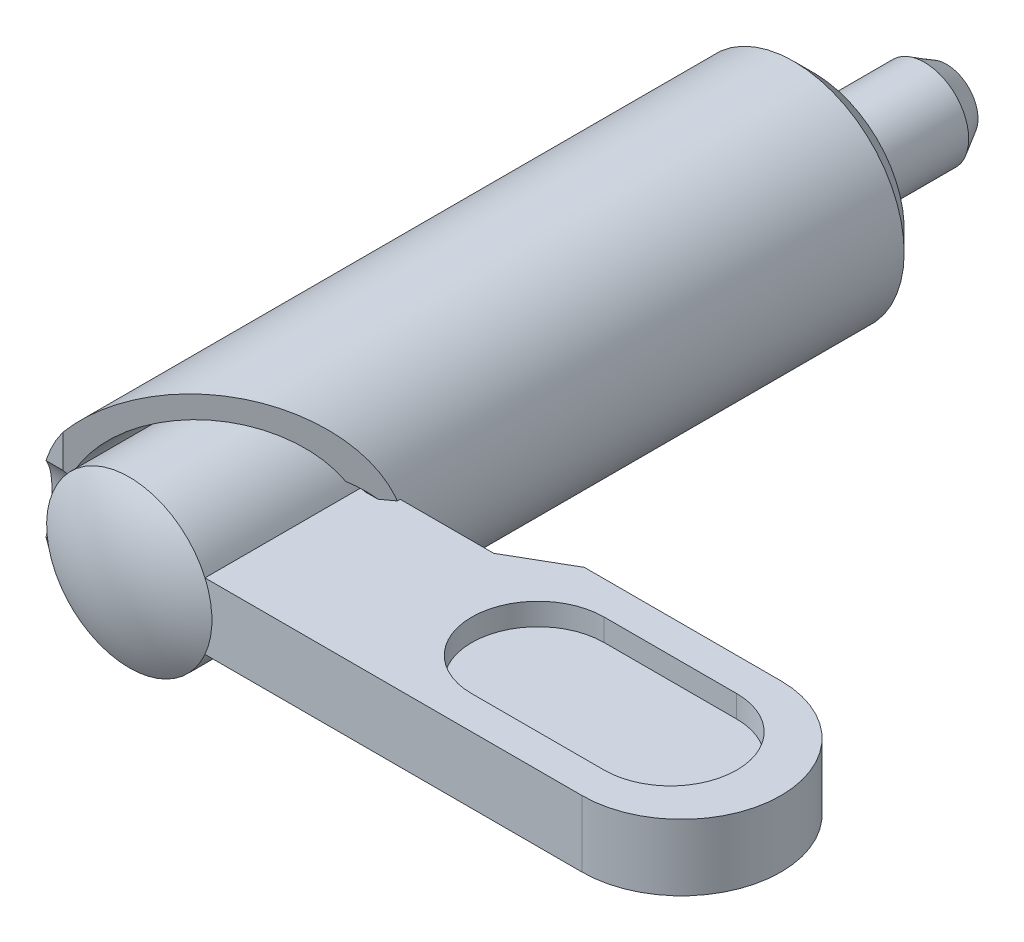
ISO-10303-21;
HEADER;
FILE_DESCRIPTION(('STEP AP214'),'2;1');
FILE_NAME('part.step','',(''),(''),'','','');
FILE_SCHEMA(('AUTOMOTIVE_DESIGN { 1 0 10303 214 1 1 1 1 }'));
ENDSEC;
DATA;
#1=APPLICATION_CONTEXT('core data for automotive mechanical design processes');
#2=APPLICATION_PROTOCOL_DEFINITION('international standard','automotive_design',2000,#1);
#3=PRODUCT_CONTEXT('',#1,'mechanical');
#4=PRODUCT('Part','Part','',(#3));
#5=PRODUCT_RELATED_PRODUCT_CATEGORY('part','',(#4));
#6=PRODUCT_DEFINITION_FORMATION('','',#4);
#7=PRODUCT_DEFINITION_CONTEXT('part definition',#1,'design');
#8=PRODUCT_DEFINITION('design','',#6,#7);
#9=PRODUCT_DEFINITION_SHAPE('','',#8);
#10=(LENGTH_UNIT() NAMED_UNIT(*) SI_UNIT(.MILLI.,.METRE.));
#11=(NAMED_UNIT(*) PLANE_ANGLE_UNIT() SI_UNIT($,.RADIAN.));
#12=(NAMED_UNIT(*) SI_UNIT($,.STERADIAN.) SOLID_ANGLE_UNIT());
#13=UNCERTAINTY_MEASURE_WITH_UNIT(LENGTH_MEASURE(1.E-05),#10,'distance_accuracy_value','');
#14=(GEOMETRIC_REPRESENTATION_CONTEXT(3) GLOBAL_UNCERTAINTY_ASSIGNED_CONTEXT((#13)) GLOBAL_UNIT_ASSIGNED_CONTEXT((#10,
#11,#12)) REPRESENTATION_CONTEXT('',''));
#15=CARTESIAN_POINT('',(0.,0.,0.));
#16=DIRECTION('',(0.,0.,1.));
#17=DIRECTION('',(1.,0.,0.));
#18=AXIS2_PLACEMENT_3D('',#15,#16,#17);
#19=CARTESIAN_POINT('',(-4.,-4.04800210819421,23.));
#20=DIRECTION('',(0.,0.,1.));
#21=DIRECTION('',(1.,0.,0.));
#22=AXIS2_PLACEMENT_3D('',#19,#20,#21);
#23=PLANE('',#22);
#24=CARTESIAN_POINT('',(0.,-1.60608234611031E-13,23.));
#25=DIRECTION('',(0.,0.,1.));
#26=DIRECTION('',(-1.,0.,0.));
#27=AXIS2_PLACEMENT_3D('',#24,#25,#26);
#28=CIRCLE('',#27,4.);
#29=CARTESIAN_POINT('',(-4.,-1.60608234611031E-13,23.));
#30=VERTEX_POINT('',#29);
#31=EDGE_CURVE('E398',#30,#30,#28,.F.);
#32=ORIENTED_EDGE('',*,*,#31,.F.);
#33=EDGE_LOOP('',(#32));
#34=FACE_BOUND('',#33,.T.);
#35=CARTESIAN_POINT('',(0.,-1.60608234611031E-13,23.));
#36=DIRECTION('',(0.,0.,1.));
#37=DIRECTION('',(0.,-1.,0.));
#38=AXIS2_PLACEMENT_3D('',#35,#36,#37);
#39=CIRCLE('',#38,3.74165738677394);
#40=CARTESIAN_POINT('',(0.,-3.7416573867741,23.));
#41=VERTEX_POINT('',#40);
#42=EDGE_CURVE('E325',#41,#41,#39,.F.);
#43=ORIENTED_EDGE('',*,*,#42,.T.);
#44=EDGE_LOOP('',(#43));
#45=FACE_BOUND('',#44,.T.);
#46=ADVANCED_FACE('F14',(#34,#45),#23,.T.);
#47=CARTESIAN_POINT('',(1.42264973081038,-1.43972574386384,-6.));
#48=DIRECTION('',(0.,0.,-1.));
#49=DIRECTION('',(-1.,0.,0.));
#50=AXIS2_PLACEMENT_3D('',#47,#48,#49);
#51=PLANE('',#50);
#52=CARTESIAN_POINT('',(0.,0.,-6.00000000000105));
#53=DIRECTION('',(0.,0.,1.));
#54=DIRECTION('',(0.,-1.,0.));
#55=AXIS2_PLACEMENT_3D('',#52,#53,#54);
#56=CIRCLE('',#55,1.42264973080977);
#57=CARTESIAN_POINT('',(0.,-1.42264973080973,-6.00000000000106));
#58=VERTEX_POINT('',#57);
#59=EDGE_CURVE('E402',#58,#58,#56,.T.);
#60=ORIENTED_EDGE('',*,*,#59,.F.);
#61=EDGE_LOOP('',(#60));
#62=FACE_BOUND('',#61,.T.);
#63=ADVANCED_FACE('F545',(#62),#51,.T.);
#64=CARTESIAN_POINT('',(0.,0.,-6.00000000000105));
#65=DIRECTION('',(0.,0.,1.));
#66=DIRECTION('',(0.,-1.,0.));
#67=AXIS2_PLACEMENT_3D('',#64,#65,#66);
#68=CONICAL_SURFACE('',#67,1.42264973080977,0.523598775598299);
#69=CARTESIAN_POINT('',(0.,0.,-5.00000000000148));
#70=DIRECTION('',(0.,0.,1.));
#71=DIRECTION('',(1.,0.,0.));
#72=AXIS2_PLACEMENT_3D('',#69,#70,#71);
#73=CIRCLE('',#72,2.);
#74=CARTESIAN_POINT('',(2.,0.,-5.00000000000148));
#75=VERTEX_POINT('',#74);
#76=EDGE_CURVE('E401',#75,#75,#73,.T.);
#77=ORIENTED_EDGE('',*,*,#76,.F.);
#78=EDGE_LOOP('',(#77));
#79=FACE_BOUND('',#78,.T.);
#80=ORIENTED_EDGE('',*,*,#59,.T.);
#81=EDGE_LOOP('',(#80));
#82=FACE_BOUND('',#81,.T.);
#83=ADVANCED_FACE('F542',(#79,#82),#68,.T.);
#84=CARTESIAN_POINT('',(0.,0.,1.47E-12));
#85=DIRECTION('',(0.,0.,1.));
#86=DIRECTION('',(0.,-1.,0.));
#87=AXIS2_PLACEMENT_3D('',#84,#85,#86);
#88=CYLINDRICAL_SURFACE('',#87,2.);
#89=CARTESIAN_POINT('',(0.,0.,1.47017814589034E-12));
#90=DIRECTION('',(0.,0.,1.));
#91=DIRECTION('',(0.,-1.,0.));
#92=AXIS2_PLACEMENT_3D('',#89,#90,#91);
#93=CIRCLE('',#92,2.);
#94=CARTESIAN_POINT('',(0.,-2.,1.45621221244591E-12));
#95=VERTEX_POINT('',#94);
#96=EDGE_CURVE('E397',#95,#95,#93,.T.);
#97=ORIENTED_EDGE('',*,*,#96,.F.);
#98=EDGE_LOOP('',(#97));
#99=FACE_BOUND('',#98,.T.);
#100=ORIENTED_EDGE('',*,*,#76,.T.);
#101=EDGE_LOOP('',(#100));
#102=FACE_BOUND('',#101,.T.);
#103=ADVANCED_FACE('F536',(#99,#102),#88,.T.);
#104=CARTESIAN_POINT('',(3.41739827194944,-1.81557134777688E-13,26.));
#105=DIRECTION('',(1.,0.,0.));
#106=DIRECTION('',(0.,0.,1.));
#107=AXIS2_PLACEMENT_3D('',#104,#105,#106);
#108=CYLINDRICAL_SURFACE('',#107,2.5);
#109=CARTESIAN_POINT('',(1.50552768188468,-1.81557134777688E-13,26.));
#110=DIRECTION('',(0.587785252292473,0.,0.809016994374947));
#111=DIRECTION('',(0.809016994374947,0.,-0.587785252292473));
#112=AXIS2_PLACEMENT_3D('',#109,#110,#111);
#113=ELLIPSE('',#112,4.2532540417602,2.5);
#114=CARTESIAN_POINT('',(3.41757756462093,2.07850032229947,24.6108144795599));
#115=VERTEX_POINT('',#114);
#116=CARTESIAN_POINT('',(3.4175776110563,-2.07850024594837,24.6108143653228));
#117=VERTEX_POINT('',#116);
#118=EDGE_CURVE('E527',#115,#117,#113,.F.);
#119=ORIENTED_EDGE('',*,*,#118,.F.);
#120=CARTESIAN_POINT('',(3.41757763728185,-2.07850020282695,24.6108143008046));
#121=CARTESIAN_POINT('',(3.44204013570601,-2.0382822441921,24.5506579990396));
#122=CARTESIAN_POINT('',(3.46702816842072,-1.99559149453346,24.4924201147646));
#123=CARTESIAN_POINT('',(3.51739313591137,-1.90541594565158,24.3799384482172));
#124=CARTESIAN_POINT('',(3.54277015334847,-1.85793011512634,24.3256955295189));
#125=CARTESIAN_POINT('',(3.61878673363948,-1.70791915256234,24.1685878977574));
#126=CARTESIAN_POINT('',(3.66899266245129,-1.59834169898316,24.0720930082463));
#127=CARTESIAN_POINT('',(3.76318752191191,-1.36184369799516,23.8983533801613));
#128=CARTESIAN_POINT('',(3.80715987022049,-1.23487859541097,23.8211595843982));
#129=CARTESIAN_POINT('',(3.86468142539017,-1.03397246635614,23.7226206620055));
#130=CARTESIAN_POINT('',(3.88243252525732,-0.965351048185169,23.6926757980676));
#131=CARTESIAN_POINT('',(3.91465106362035,-0.825036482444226,23.6388648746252));
#132=CARTESIAN_POINT('',(3.92911955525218,-0.753344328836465,23.6149968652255));
#133=CARTESIAN_POINT('',(3.96060532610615,-0.57088733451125,23.5634024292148));
#134=CARTESIAN_POINT('',(3.97527425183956,-0.458524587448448,23.5397232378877));
#135=CARTESIAN_POINT('',(3.99497385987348,-0.230783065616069,23.5080192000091));
#136=CARTESIAN_POINT('',(4.00000365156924,-0.115404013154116,23.4999957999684));
#137=CARTESIAN_POINT('',(3.99999597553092,0.127189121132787,23.5000046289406));
#138=CARTESIAN_POINT('',(3.99387798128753,0.254408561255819,23.509760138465));
#139=CARTESIAN_POINT('',(3.97001485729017,0.50480872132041,23.5482170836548));
#140=CARTESIAN_POINT('',(3.95226550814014,0.627987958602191,23.5769253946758));
#141=CARTESIAN_POINT('',(3.9069277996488,0.866361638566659,23.6516052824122));
#142=CARTESIAN_POINT('',(3.8793850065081,0.981590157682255,23.6974969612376));
#143=CARTESIAN_POINT('',(3.81672324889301,1.20242398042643,23.8047166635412));
#144=CARTESIAN_POINT('',(3.7815982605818,1.30802153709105,23.8660569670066));
#145=CARTESIAN_POINT('',(3.70335012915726,1.51609307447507,24.0078705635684));
#146=CARTESIAN_POINT('',(3.65980996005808,1.61762444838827,24.0894897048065));
#147=CARTESIAN_POINT('',(3.57049238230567,1.8062225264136,24.2667111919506));
#148=CARTESIAN_POINT('',(3.52471811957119,1.89330885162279,24.3622942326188));
#149=CARTESIAN_POINT('',(3.45878963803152,2.00962918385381,24.5117102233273));
#150=CARTESIAN_POINT('',(3.43799469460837,2.04494191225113,24.5606138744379));
#151=CARTESIAN_POINT('',(3.41757754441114,2.07850035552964,24.6108145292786));
#152=B_SPLINE_CURVE_WITH_KNOTS('',3,(#120,#121,#122,#123,#124,#125,#126,#127,#128,#129,#130,
#131,#132,#133,#134,#135,#136,#137,#138,#139,#140,#141,#142,#143,#144,#145,#146,#147,#148,#149,
#150,#151),.UNSPECIFIED.,.F.,.F.,(4,2,2,2,2,2,2,2,2,2,2,2,2,2,2,4),(0.,0.229012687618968,
0.458074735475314,0.919031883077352,1.38119312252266,1.61171006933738,1.84215295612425,
2.18792595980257,2.53373090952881,2.91484961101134,3.29610664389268,3.67561251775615,
4.05542101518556,4.46593333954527,4.87588340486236,5.06713931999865),.UNSPECIFIED.);
#153=EDGE_CURVE('E391',#117,#115,#152,.T.);
#154=ORIENTED_EDGE('',*,*,#153,.F.);
#155=EDGE_LOOP('',(#119,#154));
#156=FACE_BOUND('',#155,.T.);
#157=ADVANCED_FACE('F385',(#156),#108,.F.);
#158=CARTESIAN_POINT('',(0.,-1.60608234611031E-13,23.));
#159=DIRECTION('',(0.,0.,1.));
#160=DIRECTION('',(-1.,0.,0.));
#161=AXIS2_PLACEMENT_3D('',#158,#159,#160);
#162=CYLINDRICAL_SURFACE('',#161,4.);
#163=ORIENTED_EDGE('',*,*,#31,.T.);
#164=EDGE_LOOP('',(#163));
#165=FACE_BOUND('',#164,.T.);
#166=CARTESIAN_POINT('',(0.,-1.8919531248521E-13,27.0938298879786));
#167=DIRECTION('',(0.587785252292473,0.,0.809016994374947));
#168=DIRECTION('',(-0.809016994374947,0.,0.587785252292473));
#169=AXIS2_PLACEMENT_3D('',#166,#167,#168);
#170=ELLIPSE('',#169,4.94427190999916,4.);
#171=CARTESIAN_POINT('',(-3.79181860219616,-1.27362166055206,29.8487473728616));
#172=VERTEX_POINT('',#171);
#173=EDGE_CURVE('E351',#117,#172,#170,.F.);
#174=ORIENTED_EDGE('',*,*,#173,.F.);
#175=ORIENTED_EDGE('',*,*,#153,.T.);
#176=CARTESIAN_POINT('',(0.,-1.8919531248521E-13,27.0938298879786));
#177=DIRECTION('',(0.587785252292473,0.,0.809016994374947));
#178=DIRECTION('',(-0.809016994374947,0.,0.587785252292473));
#179=AXIS2_PLACEMENT_3D('',#176,#177,#178);
#180=ELLIPSE('',#179,4.94427190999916,4.);
#181=CARTESIAN_POINT('',(-3.79181855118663,1.27362163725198,29.8487473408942));
#182=VERTEX_POINT('',#181);
#183=EDGE_CURVE('E378',#182,#115,#180,.F.);
#184=ORIENTED_EDGE('',*,*,#183,.F.);
#185=CARTESIAN_POINT('',(-3.79181855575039,-1.2736216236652,29.8487473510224));
#186=CARTESIAN_POINT('',(-3.8095398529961,-1.22088033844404,29.8175186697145));
#187=CARTESIAN_POINT('',(-3.82648052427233,-1.16678047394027,29.7881132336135));
#188=CARTESIAN_POINT('',(-3.85850124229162,-1.05606797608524,29.73316543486));
#189=CARTESIAN_POINT('',(-3.87357976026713,-0.999453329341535,29.7076262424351));
#190=CARTESIAN_POINT('',(-3.90155714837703,-0.883960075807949,29.6606619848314));
#191=CARTESIAN_POINT('',(-3.91445440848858,-0.825079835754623,29.6392399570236));
#192=CARTESIAN_POINT('',(-3.93777055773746,-0.705463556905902,29.6007771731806));
#193=CARTESIAN_POINT('',(-3.94819048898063,-0.644728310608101,29.5837345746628));
#194=CARTESIAN_POINT('',(-3.97122129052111,-0.488422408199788,29.5462420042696));
#195=CARTESIAN_POINT('',(-3.98196601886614,-0.391787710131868,29.5289395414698));
#196=CARTESIAN_POINT('',(-3.99635385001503,-0.196780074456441,29.505822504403));
#197=CARTESIAN_POINT('',(-4.00000558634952,-0.098409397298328,29.4999939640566));
#198=CARTESIAN_POINT('',(-3.99999277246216,0.127320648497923,29.5000078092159));
#199=CARTESIAN_POINT('',(-3.99386362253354,0.254706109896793,29.5097820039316));
#200=CARTESIAN_POINT('',(-3.96991754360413,0.505681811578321,29.5483751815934));
#201=CARTESIAN_POINT('',(-3.95207299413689,0.629262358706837,29.5772391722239));
#202=CARTESIAN_POINT('',(-3.91153904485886,0.841910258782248,29.6440123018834));
#203=CARTESIAN_POINT('',(-3.89083979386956,0.932492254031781,29.6784307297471));
#204=CARTESIAN_POINT('',(-3.84464738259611,1.10766404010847,29.756729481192));
#205=CARTESIAN_POINT('',(-3.81917674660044,1.19227951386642,29.8005654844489));
#206=CARTESIAN_POINT('',(-3.79181855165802,1.27362163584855,29.8487473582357));
#207=B_SPLINE_CURVE_WITH_KNOTS('',3,(#185,#186,#187,#188,#189,#190,#191,#192,#193,#194,#195,
#196,#197,#198,#199,#200,#201,#202,#203,#204,#205,#206),.UNSPECIFIED.,.F.,.F.,(4,2,2,2,2,2,2,2,
2,2,4),(0.,0.191386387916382,0.382928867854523,0.574612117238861,0.766214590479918,
1.06151036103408,1.35644647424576,1.7380305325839,2.12051746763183,2.41704359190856,
2.71220365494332),.UNSPECIFIED.);
#208=EDGE_CURVE('E369',#172,#182,#207,.T.);
#209=ORIENTED_EDGE('',*,*,#208,.F.);
#210=EDGE_LOOP('',(#174,#175,#184,#209));
#211=FACE_BOUND('',#210,.T.);
#212=ADVANCED_FACE('F381',(#165,#211),#162,.F.);
#213=CARTESIAN_POINT('',(-4.76969600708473,-3.00900000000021,30.));
#214=DIRECTION('',(0.,0.,1.));
#215=DIRECTION('',(1.,0.,0.));
#216=AXIS2_PLACEMENT_3D('',#213,#214,#215);
#217=PLANE('',#216);
#218=CARTESIAN_POINT('',(0.,-2.09489001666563E-13,30.));
#219=DIRECTION('',(0.,0.,1.));
#220=DIRECTION('',(-1.,0.,0.));
#221=AXIS2_PLACEMENT_3D('',#218,#219,#220);
#222=CIRCLE('',#221,5.);
#223=CARTESIAN_POINT('',(-4.,-3.00000000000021,30.));
#224=VERTEX_POINT('',#223);
#225=CARTESIAN_POINT('',(-4.76969600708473,-1.5000000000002,30.));
#226=VERTEX_POINT('',#225);
#227=EDGE_CURVE('E379',#224,#226,#222,.F.);
#228=ORIENTED_EDGE('',*,*,#227,.F.);
#229=DIRECTION('',(0.,1.,0.));
#230=VECTOR('',#229,1.);
#231=CARTESIAN_POINT('',(-4.,-5.00000000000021,30.));
#232=LINE('',#231,#230);
#233=CARTESIAN_POINT('',(-4.,-1.50000000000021,30.));
#234=VERTEX_POINT('',#233);
#235=EDGE_CURVE('E504',#234,#224,#232,.F.);
#236=ORIENTED_EDGE('',*,*,#235,.F.);
#237=DIRECTION('',(1.,0.,0.));
#238=VECTOR('',#237,1.);
#239=CARTESIAN_POINT('',(-4.39590657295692,-1.5000000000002,30.));
#240=LINE('',#239,#238);
#241=EDGE_CURVE('E377',#226,#234,#240,.T.);
#242=ORIENTED_EDGE('',*,*,#241,.F.);
#243=EDGE_LOOP('',(#228,#236,#242));
#244=FACE_BOUND('',#243,.T.);
#245=ADVANCED_FACE('F363',(#244),#217,.T.);
#246=CARTESIAN_POINT('',(-3.79166167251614,-2.23454935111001E-13,32.));
#247=DIRECTION('',(-1.,0.,0.));
#248=DIRECTION('',(0.,0.,-1.));
#249=AXIS2_PLACEMENT_3D('',#246,#247,#248);
#250=CYLINDRICAL_SURFACE('',#249,2.5);
#251=DIRECTION('',(1.,0.,0.));
#252=VECTOR('',#251,1.);
#253=CARTESIAN_POINT('',(-4.38484800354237,1.49999999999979,30.));
#254=LINE('',#253,#252);
#255=CARTESIAN_POINT('',(-4.76969600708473,1.49999999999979,30.));
#256=VERTEX_POINT('',#255);
#257=CARTESIAN_POINT('',(-4.,1.49999999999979,30.));
#258=VERTEX_POINT('',#257);
#259=EDGE_CURVE('E376',#256,#258,#254,.T.);
#260=ORIENTED_EDGE('',*,*,#259,.F.);
#261=CARTESIAN_POINT('',(-4.76969600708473,-1.5000000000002,30.));
#262=CARTESIAN_POINT('',(-4.78628364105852,-1.44725770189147,29.9604486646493));
#263=CARTESIAN_POINT('',(-4.80241993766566,-1.39288339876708,29.9229244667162));
#264=CARTESIAN_POINT('',(-4.83345362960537,-1.28105388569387,29.8521424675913));
#265=CARTESIAN_POINT('',(-4.84835043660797,-1.22359723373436,29.8188866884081));
#266=CARTESIAN_POINT('',(-4.8907237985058,-1.04666316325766,29.7257396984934));
#267=CARTESIAN_POINT('',(-4.91579736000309,-0.92288596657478,29.6726678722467));
#268=CARTESIAN_POINT('',(-4.95685736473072,-0.667928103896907,29.5871516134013));
#269=CARTESIAN_POINT('',(-4.97290389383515,-0.536802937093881,29.5545706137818));
#270=CARTESIAN_POINT('',(-4.99446093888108,-0.270438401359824,29.5110234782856));
#271=CARTESIAN_POINT('',(-4.99999752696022,-0.135210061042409,29.5000038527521));
#272=CARTESIAN_POINT('',(-5.00000240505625,0.131493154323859,29.4999962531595));
#273=CARTESIAN_POINT('',(-4.9947707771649,0.262969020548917,29.5104109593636));
#274=CARTESIAN_POINT('',(-4.97435424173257,0.522235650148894,29.5516285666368));
#275=CARTESIAN_POINT('',(-4.95914613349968,0.650017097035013,29.5824789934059));
#276=CARTESIAN_POINT('',(-4.9294194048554,0.839830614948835,29.6442592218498));
#277=CARTESIAN_POINT('',(-4.91790654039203,0.904656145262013,29.6684002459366));
#278=CARTESIAN_POINT('',(-4.8928123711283,1.03178245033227,29.7218052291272));
#279=CARTESIAN_POINT('',(-4.87923058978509,1.09408263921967,29.7510703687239));
#280=CARTESIAN_POINT('',(-4.85039065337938,1.21556462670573,29.8143462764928));
#281=CARTESIAN_POINT('',(-4.83513749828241,1.27475498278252,29.8483429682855));
#282=CARTESIAN_POINT('',(-4.80331217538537,1.38988155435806,29.9208518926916));
#283=CARTESIAN_POINT('',(-4.78674075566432,1.44581958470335,29.9593615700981));
#284=CARTESIAN_POINT('',(-4.76969600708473,1.49999999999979,30.));
#285=B_SPLINE_CURVE_WITH_KNOTS('',3,(#261,#262,#263,#264,#265,#266,#267,#268,#269,#270,#271,
#272,#273,#274,#275,#276,#277,#278,#279,#280,#281,#282,#283,#284),.UNSPECIFIED.,.F.,.F.,(4,2,2,
2,2,2,2,2,2,2,2,4),(0.,0.203834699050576,0.407765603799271,0.816641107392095,1.22276183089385,
1.62787376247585,2.02184922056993,2.4167441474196,2.62690127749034,2.83710688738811,
3.04669999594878,3.25617500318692),.UNSPECIFIED.);
#286=EDGE_CURVE('E342',#226,#256,#285,.T.);
#287=ORIENTED_EDGE('',*,*,#286,.F.);
#288=ORIENTED_EDGE('',*,*,#241,.T.);
#289=CARTESIAN_POINT('',(-3.79181856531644,-1.2736215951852,29.8487473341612));
#290=CARTESIAN_POINT('',(-3.79981247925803,-1.28343141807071,29.854555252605));
#291=CARTESIAN_POINT('',(-3.8078680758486,-1.29316433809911,29.8604079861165));
#292=CARTESIAN_POINT('',(-3.82415540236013,-1.31254535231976,29.8722414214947));
#293=CARTESIAN_POINT('',(-3.83238797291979,-1.32219236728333,29.8782227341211));
#294=CARTESIAN_POINT('',(-3.84902922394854,-1.34140157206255,29.8903133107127));
#295=CARTESIAN_POINT('',(-3.85743874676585,-1.35096264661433,29.8964231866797));
#296=CARTESIAN_POINT('',(-3.87443390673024,-1.37000001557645,29.908770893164));
#297=CARTESIAN_POINT('',(-3.88302038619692,-1.37947516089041,29.9150093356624));
#298=CARTESIAN_POINT('',(-3.90036945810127,-1.39834070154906,29.9276141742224));
#299=CARTESIAN_POINT('',(-3.90913289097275,-1.40772991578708,29.9339811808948));
#300=CARTESIAN_POINT('',(-3.92683587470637,-1.42642362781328,29.9468431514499));
#301=CARTESIAN_POINT('',(-3.9357762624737,-1.43572691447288,29.9533387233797));
#302=CARTESIAN_POINT('',(-3.95383315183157,-1.45424879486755,29.9664578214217));
#303=CARTESIAN_POINT('',(-3.96295048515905,-1.46346614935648,29.9730819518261));
#304=CARTESIAN_POINT('',(-3.98136130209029,-1.48181621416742,29.986458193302));
#305=CARTESIAN_POINT('',(-3.99065561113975,-1.49094765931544,29.9932109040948));
#306=CARTESIAN_POINT('',(-4.,-1.50000000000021,30.));
#307=B_SPLINE_CURVE_WITH_KNOTS('',3,(#289,#290,#291,#292,#293,#294,#295,#296,#297,#298,#299,
#300,#301,#302,#303,#304,#305,#306),.UNSPECIFIED.,.F.,.F.,(4,2,2,2,2,2,2,2,4),(0.,
0.0417703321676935,0.0838346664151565,0.126202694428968,0.16888390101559,0.211887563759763,
0.255222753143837,0.298898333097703,0.342922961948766),.UNSPECIFIED.);
#308=EDGE_CURVE('E482',#172,#234,#307,.T.);
#309=ORIENTED_EDGE('',*,*,#308,.F.);
#310=ORIENTED_EDGE('',*,*,#208,.T.);
#311=CARTESIAN_POINT('',(-4.,1.49999999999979,30.));
#312=CARTESIAN_POINT('',(-3.99065561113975,1.49094765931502,29.9932109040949));
#313=CARTESIAN_POINT('',(-3.98136130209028,1.481816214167,29.986458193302));
#314=CARTESIAN_POINT('',(-3.96295048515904,1.46346614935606,29.9730819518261));
#315=CARTESIAN_POINT('',(-3.95383315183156,1.45424879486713,29.9664578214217));
#316=CARTESIAN_POINT('',(-3.93577626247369,1.43572691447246,29.9533387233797));
#317=CARTESIAN_POINT('',(-3.92683587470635,1.42642362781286,29.9468431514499));
#318=CARTESIAN_POINT('',(-3.90913289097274,1.40772991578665,29.9339811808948));
#319=CARTESIAN_POINT('',(-3.90036945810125,1.39834070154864,29.9276141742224));
#320=CARTESIAN_POINT('',(-3.88302038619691,1.37947516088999,29.9150093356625));
#321=CARTESIAN_POINT('',(-3.87443390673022,1.37000001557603,29.9087708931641));
#322=CARTESIAN_POINT('',(-3.85743874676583,1.35096264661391,29.8964231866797));
#323=CARTESIAN_POINT('',(-3.84902922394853,1.34140157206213,29.8903133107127));
#324=CARTESIAN_POINT('',(-3.83238797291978,1.32219236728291,29.8782227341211));
#325=CARTESIAN_POINT('',(-3.82415540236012,1.31254535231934,29.8722414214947));
#326=CARTESIAN_POINT('',(-3.8078680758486,1.29316433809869,29.8604079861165));
#327=CARTESIAN_POINT('',(-3.79981247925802,1.28343141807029,29.854555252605));
#328=CARTESIAN_POINT('',(-3.79181856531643,1.27362159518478,29.8487473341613));
#329=B_SPLINE_CURVE_WITH_KNOTS('',3,(#311,#312,#313,#314,#315,#316,#317,#318,#319,#320,#321,
#322,#323,#324,#325,#326,#327,#328),.UNSPECIFIED.,.F.,.F.,(4,2,2,2,2,2,2,2,4),(0.,
0.0440246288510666,0.0877002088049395,0.131035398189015,0.174039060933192,0.216720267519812,
0.259088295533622,0.301152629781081,0.342922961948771),.UNSPECIFIED.);
#330=EDGE_CURVE('E508',#258,#182,#329,.T.);
#331=ORIENTED_EDGE('',*,*,#330,.F.);
#332=EDGE_LOOP('',(#260,#287,#288,#309,#310,#331));
#333=FACE_BOUND('',#332,.T.);
#334=ADVANCED_FACE('F357',(#333),#250,.F.);
#335=CARTESIAN_POINT('',(-4.76969600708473,1.49999999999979,30.));
#336=DIRECTION('',(0.,0.,1.));
#337=DIRECTION('',(1.,0.,0.));
#338=AXIS2_PLACEMENT_3D('',#335,#336,#337);
#339=PLANE('',#338);
#340=DIRECTION('',(0.,1.,0.));
#341=VECTOR('',#340,1.);
#342=CARTESIAN_POINT('',(-4.,-5.00000000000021,30.));
#343=LINE('',#342,#341);
#344=CARTESIAN_POINT('',(-4.,2.99999999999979,30.));
#345=VERTEX_POINT('',#344);
#346=EDGE_CURVE('E34',#345,#258,#343,.F.);
#347=ORIENTED_EDGE('',*,*,#346,.F.);
#348=CARTESIAN_POINT('',(0.,-2.09489001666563E-13,30.));
#349=DIRECTION('',(0.,0.,1.));
#350=DIRECTION('',(-1.,0.,0.));
#351=AXIS2_PLACEMENT_3D('',#348,#349,#350);
#352=CIRCLE('',#351,5.);
#353=EDGE_CURVE('E339',#256,#345,#352,.F.);
#354=ORIENTED_EDGE('',*,*,#353,.F.);
#355=ORIENTED_EDGE('',*,*,#259,.T.);
#356=EDGE_LOOP('',(#347,#354,#355));
#357=FACE_BOUND('',#356,.T.);
#358=ADVANCED_FACE('F362',(#357),#339,.T.);
#359=CARTESIAN_POINT('',(-4.,-5.06630126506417,30.));
#360=DIRECTION('',(0.587785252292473,0.,0.809016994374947));
#361=DIRECTION('',(0.809016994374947,0.,-0.587785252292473));
#362=AXIS2_PLACEMENT_3D('',#359,#360,#361);
#363=PLANE('',#362);
#364=CARTESIAN_POINT('',(0.,-1.8919531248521E-13,27.0938298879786));
#365=DIRECTION('',(0.587785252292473,0.,0.809016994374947));
#366=DIRECTION('',(-0.809016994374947,0.,0.587785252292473));
#367=AXIS2_PLACEMENT_3D('',#364,#365,#366);
#368=ELLIPSE('',#367,6.18033988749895,5.);
#369=EDGE_CURVE('E337',#345,#224,#368,.F.);
#370=ORIENTED_EDGE('',*,*,#369,.F.);
#371=ORIENTED_EDGE('',*,*,#346,.T.);
#372=ORIENTED_EDGE('',*,*,#330,.T.);
#373=ORIENTED_EDGE('',*,*,#183,.T.);
#374=ORIENTED_EDGE('',*,*,#118,.T.);
#375=ORIENTED_EDGE('',*,*,#173,.T.);
#376=ORIENTED_EDGE('',*,*,#308,.T.);
#377=ORIENTED_EDGE('',*,*,#235,.T.);
#378=EDGE_LOOP('',(#370,#371,#372,#373,#374,#375,#376,#377));
#379=FACE_BOUND('',#378,.T.);
#380=ADVANCED_FACE('F492',(#379),#363,.T.);
#381=CARTESIAN_POINT('',(4.08,-4.12896210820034,0.));
#382=DIRECTION('',(0.,0.,-1.));
#383=DIRECTION('',(-1.,0.,0.));
#384=AXIS2_PLACEMENT_3D('',#381,#382,#383);
#385=PLANE('',#384);
#386=CARTESIAN_POINT('',(0.,0.,0.));
#387=DIRECTION('',(0.,0.,1.));
#388=DIRECTION('',(-1.,0.,0.));
#389=AXIS2_PLACEMENT_3D('',#386,#387,#388);
#390=CIRCLE('',#389,4.08);
#391=CARTESIAN_POINT('',(-4.08,0.,0.));
#392=VERTEX_POINT('',#391);
#393=EDGE_CURVE('E25',#392,#392,#390,.T.);
#394=ORIENTED_EDGE('',*,*,#393,.F.);
#395=EDGE_LOOP('',(#394));
#396=FACE_BOUND('',#395,.T.);
#397=ORIENTED_EDGE('',*,*,#96,.T.);
#398=EDGE_LOOP('',(#397));
#399=FACE_BOUND('',#398,.T.);
#400=ADVANCED_FACE('F491',(#396,#399),#385,.T.);
#401=CARTESIAN_POINT('',(0.,-2.09489001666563E-13,30.));
#402=DIRECTION('',(0.,0.,1.));
#403=DIRECTION('',(-1.,0.,0.));
#404=AXIS2_PLACEMENT_3D('',#401,#402,#403);
#405=CYLINDRICAL_SURFACE('',#404,5.);
#406=CARTESIAN_POINT('',(0.,0.,0.92000000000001));
#407=DIRECTION('',(0.,0.,-1.));
#408=DIRECTION('',(1.,0.,0.));
#409=AXIS2_PLACEMENT_3D('',#406,#407,#408);
#410=CIRCLE('',#409,5.);
#411=CARTESIAN_POINT('',(5.,0.,0.92000000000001));
#412=VERTEX_POINT('',#411);
#413=EDGE_CURVE('E9',#412,#412,#410,.T.);
#414=ORIENTED_EDGE('',*,*,#413,.F.);
#415=EDGE_LOOP('',(#414));
#416=FACE_BOUND('',#415,.T.);
#417=ORIENTED_EDGE('',*,*,#353,.T.);
#418=ORIENTED_EDGE('',*,*,#369,.T.);
#419=ORIENTED_EDGE('',*,*,#227,.T.);
#420=ORIENTED_EDGE('',*,*,#286,.T.);
#421=EDGE_LOOP('',(#417,#418,#419,#420));
#422=FACE_BOUND('',#421,.T.);
#423=ADVANCED_FACE('F353',(#416,#422),#405,.T.);
#424=CARTESIAN_POINT('',(0.,0.,0.));
#425=DIRECTION('',(0.,0.,1.));
#426=DIRECTION('',(-1.,0.,0.));
#427=AXIS2_PLACEMENT_3D('',#424,#425,#426);
#428=CONICAL_SURFACE('',#427,4.08,0.785398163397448);
#429=ORIENTED_EDGE('',*,*,#413,.T.);
#430=EDGE_LOOP('',(#429));
#431=FACE_BOUND('',#430,.T.);
#432=ORIENTED_EDGE('',*,*,#393,.T.);
#433=EDGE_LOOP('',(#432));
#434=FACE_BOUND('',#433,.T.);
#435=ADVANCED_FACE('F548',(#431,#434),#428,.T.);
#436=CARTESIAN_POINT('',(23.12,0.499999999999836,23.5));
#437=CARTESIAN_POINT('',(23.,0.499999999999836,23.5));
#438=CARTESIAN_POINT('',(11.,0.499999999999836,23.5));
#439=CARTESIAN_POINT('',(10.8788,0.499999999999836,23.5));
#440=B_SPLINE_CURVE_WITH_KNOTS('',1,(#436,#437,#438,#439),.UNSPECIFIED.,.F.,.F.,(2,1,1,2),
(-0.01,0.,1.,1.0101),.UNSPECIFIED.);
#441=DIRECTION('',(0.,0.,1.));
#442=VECTOR('',#441,1.);
#443=SURFACE_OF_LINEAR_EXTRUSION('',#440,#442);
#444=DIRECTION('',(1.,0.,0.));
#445=VECTOR('',#444,1.);
#446=CARTESIAN_POINT('',(17.,0.499999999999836,23.5));
#447=LINE('',#446,#445);
#448=CARTESIAN_POINT('',(14.,0.499999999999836,23.5));
#449=VERTEX_POINT('',#448);
#450=CARTESIAN_POINT('',(20.,0.499999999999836,23.5));
#451=VERTEX_POINT('',#450);
#452=EDGE_CURVE('E249',#449,#451,#447,.T.);
#453=ORIENTED_EDGE('',*,*,#452,.F.);
#454=CARTESIAN_POINT('',(14.,0.499999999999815,26.5));
#455=DIRECTION('',(0.,-1.,0.));
#456=DIRECTION('',(0.,0.,-1.));
#457=AXIS2_PLACEMENT_3D('',#454,#455,#456);
#458=CIRCLE('',#457,3.);
#459=CARTESIAN_POINT('',(14.,0.499999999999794,29.5));
#460=VERTEX_POINT('',#459);
#461=EDGE_CURVE('E19',#460,#449,#458,.T.);
#462=ORIENTED_EDGE('',*,*,#461,.F.);
#463=DIRECTION('',(-1.,0.,0.));
#464=VECTOR('',#463,1.);
#465=CARTESIAN_POINT('',(17.,0.499999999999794,29.5));
#466=LINE('',#465,#464);
#467=CARTESIAN_POINT('',(20.,0.499999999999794,29.5));
#468=VERTEX_POINT('',#467);
#469=EDGE_CURVE('E318',#468,#460,#466,.T.);
#470=ORIENTED_EDGE('',*,*,#469,.F.);
#471=CARTESIAN_POINT('',(20.,0.499999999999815,26.5));
#472=DIRECTION('',(0.,-1.,0.));
#473=DIRECTION('',(0.,0.,-1.));
#474=AXIS2_PLACEMENT_3D('',#471,#472,#473);
#475=CIRCLE('',#474,3.);
#476=EDGE_CURVE('E243',#451,#468,#475,.T.);
#477=ORIENTED_EDGE('',*,*,#476,.F.);
#478=EDGE_LOOP('',(#453,#462,#470,#477));
#479=FACE_BOUND('',#478,.T.);
#480=ADVANCED_FACE('F16',(#479),#443,.T.);
#481=CARTESIAN_POINT('',(10.8788,-0.500000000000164,23.5));
#482=CARTESIAN_POINT('',(11.,-0.500000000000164,23.5));
#483=CARTESIAN_POINT('',(23.,-0.500000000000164,23.5));
#484=CARTESIAN_POINT('',(23.12,-0.500000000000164,23.5));
#485=B_SPLINE_CURVE_WITH_KNOTS('',1,(#481,#482,#483,#484),.UNSPECIFIED.,.F.,.F.,(2,1,1,2),
(-0.0101,0.,1.,1.01),.UNSPECIFIED.);
#486=DIRECTION('',(0.,0.,1.));
#487=VECTOR('',#486,1.);
#488=SURFACE_OF_LINEAR_EXTRUSION('',#485,#487);
#489=DIRECTION('',(1.,0.,0.));
#490=VECTOR('',#489,1.);
#491=CARTESIAN_POINT('',(17.,-0.500000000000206,29.5));
#492=LINE('',#491,#490);
#493=CARTESIAN_POINT('',(14.,-0.500000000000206,29.5));
#494=VERTEX_POINT('',#493);
#495=CARTESIAN_POINT('',(20.,-0.500000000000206,29.5));
#496=VERTEX_POINT('',#495);
#497=EDGE_CURVE('E226',#494,#496,#492,.T.);
#498=ORIENTED_EDGE('',*,*,#497,.F.);
#499=CARTESIAN_POINT('',(14.,-0.500000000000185,26.5));
#500=DIRECTION('',(0.,1.,0.));
#501=DIRECTION('',(0.,0.,1.));
#502=AXIS2_PLACEMENT_3D('',#499,#500,#501);
#503=CIRCLE('',#502,3.);
#504=CARTESIAN_POINT('',(14.,-0.500000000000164,23.5));
#505=VERTEX_POINT('',#504);
#506=EDGE_CURVE('E230',#505,#494,#503,.T.);
#507=ORIENTED_EDGE('',*,*,#506,.F.);
#508=DIRECTION('',(-1.,0.,0.));
#509=VECTOR('',#508,1.);
#510=CARTESIAN_POINT('',(17.,-0.500000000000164,23.5));
#511=LINE('',#510,#509);
#512=CARTESIAN_POINT('',(20.,-0.500000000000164,23.5));
#513=VERTEX_POINT('',#512);
#514=EDGE_CURVE('E233',#513,#505,#511,.T.);
#515=ORIENTED_EDGE('',*,*,#514,.F.);
#516=CARTESIAN_POINT('',(20.,-0.500000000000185,26.5));
#517=DIRECTION('',(0.,1.,0.));
#518=DIRECTION('',(0.,0.,1.));
#519=AXIS2_PLACEMENT_3D('',#516,#517,#518);
#520=CIRCLE('',#519,3.);
#521=EDGE_CURVE('E219',#496,#513,#520,.T.);
#522=ORIENTED_EDGE('',*,*,#521,.F.);
#523=EDGE_LOOP('',(#498,#507,#515,#522));
#524=FACE_BOUND('',#523,.T.);
#525=ADVANCED_FACE('F265',(#524),#488,.T.);
#526=CARTESIAN_POINT('',(14.,1.49999999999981,26.5));
#527=DIRECTION('',(0.,-1.,0.));
#528=DIRECTION('',(0.,0.,-1.));
#529=AXIS2_PLACEMENT_3D('',#526,#527,#528);
#530=CYLINDRICAL_SURFACE('',#529,3.);
#531=CARTESIAN_POINT('',(14.,1.49999999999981,26.5));
#532=DIRECTION('',(0.,-1.,0.));
#533=DIRECTION('',(0.,0.,-1.));
#534=AXIS2_PLACEMENT_3D('',#531,#532,#533);
#535=CIRCLE('',#534,3.);
#536=CARTESIAN_POINT('',(14.,1.49999999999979,29.5));
#537=VERTEX_POINT('',#536);
#538=CARTESIAN_POINT('',(14.,1.49999999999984,23.5));
#539=VERTEX_POINT('',#538);
#540=EDGE_CURVE('E323',#537,#539,#535,.T.);
#541=ORIENTED_EDGE('',*,*,#540,.F.);
#542=DIRECTION('',(0.,-1.,0.));
#543=VECTOR('',#542,1.);
#544=CARTESIAN_POINT('',(14.,0.999999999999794,29.5));
#545=LINE('',#544,#543);
#546=EDGE_CURVE('E250',#537,#460,#545,.T.);
#547=ORIENTED_EDGE('',*,*,#546,.T.);
#548=ORIENTED_EDGE('',*,*,#461,.T.);
#549=DIRECTION('',(0.,-1.,0.));
#550=VECTOR('',#549,1.);
#551=CARTESIAN_POINT('',(14.,1.49999999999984,23.5));
#552=LINE('',#551,#550);
#553=EDGE_CURVE('E246',#539,#449,#552,.T.);
#554=ORIENTED_EDGE('',*,*,#553,.F.);
#555=EDGE_LOOP('',(#541,#547,#548,#554));
#556=FACE_BOUND('',#555,.T.);
#557=ADVANCED_FACE('F268',(#556),#530,.F.);
#558=CARTESIAN_POINT('',(14.,1.49999999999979,29.5));
#559=DIRECTION('',(0.,0.,-1.));
#560=DIRECTION('',(1.,0.,0.));
#561=AXIS2_PLACEMENT_3D('',#558,#559,#560);
#562=PLANE('',#561);
#563=DIRECTION('',(-1.,0.,0.));
#564=VECTOR('',#563,1.);
#565=CARTESIAN_POINT('',(14.3217745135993,1.49999999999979,29.5));
#566=LINE('',#565,#564);
#567=CARTESIAN_POINT('',(20.,1.49999999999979,29.5));
#568=VERTEX_POINT('',#567);
#569=EDGE_CURVE('E418',#568,#537,#566,.T.);
#570=ORIENTED_EDGE('',*,*,#569,.F.);
#571=DIRECTION('',(0.,1.,0.));
#572=VECTOR('',#571,1.);
#573=CARTESIAN_POINT('',(20.,0.999999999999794,29.5));
#574=LINE('',#573,#572);
#575=EDGE_CURVE('E240',#468,#568,#574,.T.);
#576=ORIENTED_EDGE('',*,*,#575,.F.);
#577=ORIENTED_EDGE('',*,*,#469,.T.);
#578=ORIENTED_EDGE('',*,*,#546,.F.);
#579=EDGE_LOOP('',(#570,#576,#577,#578));
#580=FACE_BOUND('',#579,.T.);
#581=ADVANCED_FACE('F270',(#580),#562,.T.);
#582=CARTESIAN_POINT('',(20.,1.49999999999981,26.5));
#583=DIRECTION('',(0.,-1.,0.));
#584=DIRECTION('',(0.,0.,-1.));
#585=AXIS2_PLACEMENT_3D('',#582,#583,#584);
#586=CYLINDRICAL_SURFACE('',#585,3.);
#587=CARTESIAN_POINT('',(20.,1.49999999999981,26.5));
#588=DIRECTION('',(0.,-1.,0.));
#589=DIRECTION('',(0.,0.,-1.));
#590=AXIS2_PLACEMENT_3D('',#587,#588,#589);
#591=CIRCLE('',#590,3.);
#592=CARTESIAN_POINT('',(20.,1.49999999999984,23.5));
#593=VERTEX_POINT('',#592);
#594=EDGE_CURVE('E161',#593,#568,#591,.T.);
#595=ORIENTED_EDGE('',*,*,#594,.F.);
#596=DIRECTION('',(0.,-1.,0.));
#597=VECTOR('',#596,1.);
#598=CARTESIAN_POINT('',(20.,0.999999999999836,23.5));
#599=LINE('',#598,#597);
#600=EDGE_CURVE('E236',#593,#451,#599,.T.);
#601=ORIENTED_EDGE('',*,*,#600,.T.);
#602=ORIENTED_EDGE('',*,*,#476,.T.);
#603=ORIENTED_EDGE('',*,*,#575,.T.);
#604=EDGE_LOOP('',(#595,#601,#602,#603));
#605=FACE_BOUND('',#604,.T.);
#606=ADVANCED_FACE('F273',(#605),#586,.F.);
#607=CARTESIAN_POINT('',(20.,1.49999999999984,23.5));
#608=DIRECTION('',(0.,0.,1.));
#609=DIRECTION('',(-1.,0.,0.));
#610=AXIS2_PLACEMENT_3D('',#607,#608,#609);
#611=PLANE('',#610);
#612=DIRECTION('',(1.,0.,0.));
#613=VECTOR('',#612,1.);
#614=CARTESIAN_POINT('',(14.3217745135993,1.49999999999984,23.5));
#615=LINE('',#614,#613);
#616=EDGE_CURVE('E190',#539,#593,#615,.T.);
#617=ORIENTED_EDGE('',*,*,#616,.F.);
#618=ORIENTED_EDGE('',*,*,#553,.T.);
#619=ORIENTED_EDGE('',*,*,#452,.T.);
#620=ORIENTED_EDGE('',*,*,#600,.F.);
#621=EDGE_LOOP('',(#617,#618,#619,#620));
#622=FACE_BOUND('',#621,.T.);
#623=ADVANCED_FACE('F278',(#622),#611,.T.);
#624=CARTESIAN_POINT('',(20.5,-1.50000000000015,22.));
#625=DIRECTION('',(0.,0.,-1.));
#626=DIRECTION('',(-1.,0.,0.));
#627=AXIS2_PLACEMENT_3D('',#624,#625,#626);
#628=PLANE('',#627);
#629=DIRECTION('',(1.,0.,0.));
#630=VECTOR('',#629,1.);
#631=CARTESIAN_POINT('',(14.3217745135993,-1.50000000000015,22.));
#632=LINE('',#631,#630);
#633=CARTESIAN_POINT('',(11.6,-1.50000000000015,22.));
#634=VERTEX_POINT('',#633);
#635=CARTESIAN_POINT('',(20.5,-1.50000000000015,22.));
#636=VERTEX_POINT('',#635);
#637=EDGE_CURVE('E417',#634,#636,#632,.T.);
#638=ORIENTED_EDGE('',*,*,#637,.F.);
#639=DIRECTION('',(0.,1.,0.));
#640=VECTOR('',#639,1.);
#641=CARTESIAN_POINT('',(11.6,-1.50000000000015,22.));
#642=LINE('',#641,#640);
#643=CARTESIAN_POINT('',(11.6,1.49999999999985,22.));
#644=VERTEX_POINT('',#643);
#645=EDGE_CURVE('E160',#644,#634,#642,.F.);
#646=ORIENTED_EDGE('',*,*,#645,.F.);
#647=DIRECTION('',(-1.,0.,0.));
#648=VECTOR('',#647,1.);
#649=CARTESIAN_POINT('',(14.3217745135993,1.49999999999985,22.));
#650=LINE('',#649,#648);
#651=CARTESIAN_POINT('',(20.5,1.49999999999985,22.));
#652=VERTEX_POINT('',#651);
#653=EDGE_CURVE('E157',#652,#644,#650,.T.);
#654=ORIENTED_EDGE('',*,*,#653,.F.);
#655=DIRECTION('',(0.,1.,0.));
#656=VECTOR('',#655,1.);
#657=CARTESIAN_POINT('',(20.5,-1.53625267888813E-13,22.));
#658=LINE('',#657,#656);
#659=EDGE_CURVE('E234',#636,#652,#658,.T.);
#660=ORIENTED_EDGE('',*,*,#659,.F.);
#661=EDGE_LOOP('',(#638,#646,#654,#660));
#662=FACE_BOUND('',#661,.T.);
#663=ADVANCED_FACE('F281',(#662),#628,.T.);
#664=CARTESIAN_POINT('',(3.42782730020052,-1.50000000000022,31.));
#665=DIRECTION('',(0.,0.,1.));
#666=DIRECTION('',(1.,0.,0.));
#667=AXIS2_PLACEMENT_3D('',#664,#665,#666);
#668=PLANE('',#667);
#669=DIRECTION('',(0.,1.,0.));
#670=VECTOR('',#669,1.);
#671=CARTESIAN_POINT('',(20.5,-1.50000000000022,31.));
#672=LINE('',#671,#670);
#673=CARTESIAN_POINT('',(20.5,-1.50000000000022,31.));
#674=VERTEX_POINT('',#673);
#675=CARTESIAN_POINT('',(20.5,1.49999999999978,31.));
#676=VERTEX_POINT('',#675);
#677=EDGE_CURVE('E231',#674,#676,#672,.T.);
#678=ORIENTED_EDGE('',*,*,#677,.T.);
#679=DIRECTION('',(1.,0.,0.));
#680=VECTOR('',#679,1.);
#681=CARTESIAN_POINT('',(14.3217745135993,1.49999999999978,31.));
#682=LINE('',#681,#680);
#683=CARTESIAN_POINT('',(3.42782730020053,1.49999999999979,31.0000000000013));
#684=VERTEX_POINT('',#683);
#685=EDGE_CURVE('E422',#684,#676,#682,.T.);
#686=ORIENTED_EDGE('',*,*,#685,.F.);
#687=CARTESIAN_POINT('',(3.42782730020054,-1.50000000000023,31.));
#688=CARTESIAN_POINT('',(3.47000498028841,-1.40364028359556,31.));
#689=CARTESIAN_POINT('',(3.50809870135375,-1.30549843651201,31.));
#690=CARTESIAN_POINT('',(3.57589326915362,-1.10635930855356,31.));
#691=CARTESIAN_POINT('',(3.60559427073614,-1.00536208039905,31.));
#692=CARTESIAN_POINT('',(3.65638602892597,-0.801193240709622,31.));
#693=CARTESIAN_POINT('',(3.67747474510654,-0.698021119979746,31.));
#694=CARTESIAN_POINT('',(3.710887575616,-0.49029795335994,31.));
#695=CARTESIAN_POINT('',(3.72321206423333,-0.385746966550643,31.));
#696=CARTESIAN_POINT('',(3.74688800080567,-0.0709807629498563,31.));
#697=CARTESIAN_POINT('',(3.74495049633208,0.14038231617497,31.));
#698=CARTESIAN_POINT('',(3.70556982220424,0.55943701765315,31.));
#699=CARTESIAN_POINT('',(3.66818371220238,0.767133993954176,31.));
#700=CARTESIAN_POINT('',(3.58941923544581,1.06061054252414,31.));
#701=CARTESIAN_POINT('',(3.56170810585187,1.15023176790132,31.));
#702=CARTESIAN_POINT('',(3.49968016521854,1.32702391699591,31.));
#703=CARTESIAN_POINT('',(3.46537223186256,1.4141979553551,31.));
#704=CARTESIAN_POINT('',(3.42782730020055,1.49999999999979,31.));
#705=B_SPLINE_CURVE_WITH_KNOTS('',3,(#687,#688,#689,#690,#691,#692,#693,#694,#695,#696,#697,
#698,#699,#700,#701,#702,#703,#704),.UNSPECIFIED.,.F.,.F.,(4,2,2,2,2,2,2,2,4),(0.,
0.315456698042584,0.630907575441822,0.946433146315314,1.26194524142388,1.89286379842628,
2.5227685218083,2.80396781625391,3.08479130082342),.UNSPECIFIED.);
#706=CARTESIAN_POINT('',(3.42782730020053,-1.50000000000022,31.0000000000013));
#707=VERTEX_POINT('',#706);
#708=EDGE_CURVE('E222',#707,#684,#705,.T.);
#709=ORIENTED_EDGE('',*,*,#708,.F.);
#710=DIRECTION('',(-1.,0.,0.));
#711=VECTOR('',#710,1.);
#712=CARTESIAN_POINT('',(14.3217745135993,-1.50000000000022,31.));
#713=LINE('',#712,#711);
#714=EDGE_CURVE('E416',#674,#707,#713,.T.);
#715=ORIENTED_EDGE('',*,*,#714,.F.);
#716=EDGE_LOOP('',(#678,#686,#709,#715));
#717=FACE_BOUND('',#716,.T.);
#718=ADVANCED_FACE('F288',(#717),#668,.T.);
#719=CARTESIAN_POINT('',(20.5,1.49999999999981,26.5));
#720=DIRECTION('',(0.,1.,0.));
#721=DIRECTION('',(0.,0.,1.));
#722=AXIS2_PLACEMENT_3D('',#719,#720,#721);
#723=CYLINDRICAL_SURFACE('',#722,4.5);
#724=CARTESIAN_POINT('',(20.5,-1.50000000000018,26.5));
#725=DIRECTION('',(0.,1.,0.));
#726=DIRECTION('',(0.,0.,1.));
#727=AXIS2_PLACEMENT_3D('',#724,#725,#726);
#728=CIRCLE('',#727,4.5);
#729=EDGE_CURVE('E413',#636,#674,#728,.F.);
#730=ORIENTED_EDGE('',*,*,#729,.F.);
#731=ORIENTED_EDGE('',*,*,#659,.T.);
#732=CARTESIAN_POINT('',(20.5,1.49999999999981,26.5));
#733=DIRECTION('',(0.,1.,0.));
#734=DIRECTION('',(0.,0.,1.));
#735=AXIS2_PLACEMENT_3D('',#732,#733,#734);
#736=CIRCLE('',#735,4.5);
#737=EDGE_CURVE('E308',#676,#652,#736,.T.);
#738=ORIENTED_EDGE('',*,*,#737,.F.);
#739=ORIENTED_EDGE('',*,*,#677,.F.);
#740=EDGE_LOOP('',(#730,#731,#738,#739));
#741=FACE_BOUND('',#740,.T.);
#742=ADVANCED_FACE('F290',(#741),#723,.T.);
#743=CARTESIAN_POINT('',(14.,-1.50000000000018,26.5));
#744=DIRECTION('',(0.,1.,0.));
#745=DIRECTION('',(0.,0.,1.));
#746=AXIS2_PLACEMENT_3D('',#743,#744,#745);
#747=CYLINDRICAL_SURFACE('',#746,3.);
#748=CARTESIAN_POINT('',(14.,-1.50000000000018,26.5));
#749=DIRECTION('',(0.,1.,0.));
#750=DIRECTION('',(0.,0.,1.));
#751=AXIS2_PLACEMENT_3D('',#748,#749,#750);
#752=CIRCLE('',#751,3.);
#753=CARTESIAN_POINT('',(14.,-1.50000000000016,23.5));
#754=VERTEX_POINT('',#753);
#755=CARTESIAN_POINT('',(14.,-1.5000000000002,29.5));
#756=VERTEX_POINT('',#755);
#757=EDGE_CURVE('E409',#754,#756,#752,.T.);
#758=ORIENTED_EDGE('',*,*,#757,.F.);
#759=DIRECTION('',(0.,1.,0.));
#760=VECTOR('',#759,1.);
#761=CARTESIAN_POINT('',(14.,-1.00000000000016,23.5));
#762=LINE('',#761,#760);
#763=EDGE_CURVE('E227',#754,#505,#762,.T.);
#764=ORIENTED_EDGE('',*,*,#763,.T.);
#765=ORIENTED_EDGE('',*,*,#506,.T.);
#766=DIRECTION('',(0.,1.,0.));
#767=VECTOR('',#766,1.);
#768=CARTESIAN_POINT('',(14.,-1.5000000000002,29.5));
#769=LINE('',#768,#767);
#770=EDGE_CURVE('E223',#756,#494,#769,.T.);
#771=ORIENTED_EDGE('',*,*,#770,.F.);
#772=EDGE_LOOP('',(#758,#764,#765,#771));
#773=FACE_BOUND('',#772,.T.);
#774=ADVANCED_FACE('F293',(#773),#747,.F.);
#775=CARTESIAN_POINT('',(14.,-1.50000000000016,23.5));
#776=DIRECTION('',(0.,0.,1.));
#777=DIRECTION('',(1.,0.,0.));
#778=AXIS2_PLACEMENT_3D('',#775,#776,#777);
#779=PLANE('',#778);
#780=DIRECTION('',(-1.,0.,0.));
#781=VECTOR('',#780,1.);
#782=CARTESIAN_POINT('',(14.3217745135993,-1.50000000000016,23.5));
#783=LINE('',#782,#781);
#784=CARTESIAN_POINT('',(20.,-1.50000000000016,23.5));
#785=VERTEX_POINT('',#784);
#786=EDGE_CURVE('E412',#785,#754,#783,.T.);
#787=ORIENTED_EDGE('',*,*,#786,.F.);
#788=DIRECTION('',(0.,-1.,0.));
#789=VECTOR('',#788,1.);
#790=CARTESIAN_POINT('',(20.,-1.00000000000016,23.5));
#791=LINE('',#790,#789);
#792=EDGE_CURVE('E215',#513,#785,#791,.T.);
#793=ORIENTED_EDGE('',*,*,#792,.F.);
#794=ORIENTED_EDGE('',*,*,#514,.T.);
#795=ORIENTED_EDGE('',*,*,#763,.F.);
#796=EDGE_LOOP('',(#787,#793,#794,#795));
#797=FACE_BOUND('',#796,.T.);
#798=ADVANCED_FACE('F299',(#797),#779,.T.);
#799=CARTESIAN_POINT('',(20.,-1.50000000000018,26.5));
#800=DIRECTION('',(0.,1.,0.));
#801=DIRECTION('',(0.,0.,1.));
#802=AXIS2_PLACEMENT_3D('',#799,#800,#801);
#803=CYLINDRICAL_SURFACE('',#802,3.);
#804=CARTESIAN_POINT('',(20.,-1.50000000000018,26.5));
#805=DIRECTION('',(0.,1.,0.));
#806=DIRECTION('',(0.,0.,1.));
#807=AXIS2_PLACEMENT_3D('',#804,#805,#806);
#808=CIRCLE('',#807,3.);
#809=CARTESIAN_POINT('',(20.,-1.5000000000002,29.5));
#810=VERTEX_POINT('',#809);
#811=EDGE_CURVE('E405',#810,#785,#808,.T.);
#812=ORIENTED_EDGE('',*,*,#811,.F.);
#813=DIRECTION('',(0.,1.,0.));
#814=VECTOR('',#813,1.);
#815=CARTESIAN_POINT('',(20.,-1.00000000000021,29.5));
#816=LINE('',#815,#814);
#817=EDGE_CURVE('E218',#810,#496,#816,.T.);
#818=ORIENTED_EDGE('',*,*,#817,.T.);
#819=ORIENTED_EDGE('',*,*,#521,.T.);
#820=ORIENTED_EDGE('',*,*,#792,.T.);
#821=EDGE_LOOP('',(#812,#818,#819,#820));
#822=FACE_BOUND('',#821,.T.);
#823=ADVANCED_FACE('F207',(#822),#803,.F.);
#824=CARTESIAN_POINT('',(20.,-1.5000000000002,29.5));
#825=DIRECTION('',(0.,0.,-1.));
#826=DIRECTION('',(-1.,0.,0.));
#827=AXIS2_PLACEMENT_3D('',#824,#825,#826);
#828=PLANE('',#827);
#829=DIRECTION('',(1.,0.,0.));
#830=VECTOR('',#829,1.);
#831=CARTESIAN_POINT('',(14.3217745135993,-1.5000000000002,29.5));
#832=LINE('',#831,#830);
#833=EDGE_CURVE('E408',#756,#810,#832,.T.);
#834=ORIENTED_EDGE('',*,*,#833,.F.);
#835=ORIENTED_EDGE('',*,*,#770,.T.);
#836=ORIENTED_EDGE('',*,*,#497,.T.);
#837=ORIENTED_EDGE('',*,*,#817,.F.);
#838=EDGE_LOOP('',(#834,#835,#836,#837));
#839=FACE_BOUND('',#838,.T.);
#840=ADVANCED_FACE('F728',(#839),#828,.T.);
#841=CARTESIAN_POINT('',(11.6,-1.50000000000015,22.));
#842=DIRECTION('',(-0.499722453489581,0.,-0.866185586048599));
#843=DIRECTION('',(-0.866185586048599,0.,0.499722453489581));
#844=AXIS2_PLACEMENT_3D('',#841,#842,#843);
#845=PLANE('',#844);
#846=CARTESIAN_POINT('',(9.00000000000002,-1.50000000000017,23.5));
#847=CARTESIAN_POINT('',(9.10833333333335,-1.50000000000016,23.4375));
#848=CARTESIAN_POINT('',(9.21666666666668,-1.50000000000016,23.375));
#849=CARTESIAN_POINT('',(9.43333333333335,-1.50000000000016,23.25));
#850=CARTESIAN_POINT('',(9.54166666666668,-1.50000000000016,23.1875));
#851=CARTESIAN_POINT('',(9.75833333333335,-1.50000000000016,23.0625));
#852=CARTESIAN_POINT('',(9.86666666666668,-1.50000000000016,23.));
#853=CARTESIAN_POINT('',(10.0833333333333,-1.50000000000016,22.875));
#854=CARTESIAN_POINT('',(10.1916666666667,-1.50000000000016,22.8125));
#855=CARTESIAN_POINT('',(10.4083333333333,-1.50000000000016,22.6875));
#856=CARTESIAN_POINT('',(10.5166666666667,-1.50000000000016,22.625));
#857=CARTESIAN_POINT('',(10.7333333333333,-1.50000000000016,22.5));
#858=CARTESIAN_POINT('',(10.8416666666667,-1.50000000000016,22.4375));
#859=CARTESIAN_POINT('',(11.0583333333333,-1.50000000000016,22.3125));
#860=CARTESIAN_POINT('',(11.1666666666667,-1.50000000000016,22.25));
#861=CARTESIAN_POINT('',(11.3833333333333,-1.50000000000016,22.125));
#862=CARTESIAN_POINT('',(11.4916666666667,-1.50000000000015,22.0625));
#863=CARTESIAN_POINT('',(11.6,-1.50000000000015,22.));
#864=B_SPLINE_CURVE_WITH_KNOTS('',3,(#846,#847,#848,#849,#850,#851,#852,#853,#854,#855,#856,
#857,#858,#859,#860,#861,#862,#863),.UNSPECIFIED.,.F.,.F.,(4,2,2,2,2,2,2,2,4),(0.,
0.375208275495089,0.750416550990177,1.12562482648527,1.50083310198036,1.87604137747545,
2.25124965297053,2.62645792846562,3.00166620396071),.UNSPECIFIED.);
#865=CARTESIAN_POINT('',(9.,-1.50000000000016,23.5));
#866=VERTEX_POINT('',#865);
#867=EDGE_CURVE('E167',#866,#634,#864,.T.);
#868=ORIENTED_EDGE('',*,*,#867,.F.);
#869=DIRECTION('',(0.,1.,0.));
#870=VECTOR('',#869,1.);
#871=CARTESIAN_POINT('',(9.,-3.74165738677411,23.5));
#872=LINE('',#871,#870);
#873=CARTESIAN_POINT('',(9.,1.49999999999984,23.5));
#874=VERTEX_POINT('',#873);
#875=EDGE_CURVE('E164',#874,#866,#872,.F.);
#876=ORIENTED_EDGE('',*,*,#875,.F.);
#877=DIRECTION('',(0.866185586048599,0.,-0.499722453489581));
#878=VECTOR('',#877,1.);
#879=CARTESIAN_POINT('',(10.3,1.49999999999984,22.75));
#880=LINE('',#879,#878);
#881=EDGE_CURVE('E152',#874,#644,#880,.T.);
#882=ORIENTED_EDGE('',*,*,#881,.T.);
#883=ORIENTED_EDGE('',*,*,#645,.T.);
#884=EDGE_LOOP('',(#868,#876,#882,#883));
#885=FACE_BOUND('',#884,.T.);
#886=ADVANCED_FACE('F165',(#885),#845,.T.);
#887=CARTESIAN_POINT('',(25.215721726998,1.49999999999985,22.));
#888=CARTESIAN_POINT('',(25.,1.49999999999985,22.));
#889=CARTESIAN_POINT('',(3.42782730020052,1.49999999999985,22.));
#890=B_SPLINE_CURVE_WITH_KNOTS('',1,(#887,#888,#889),.UNSPECIFIED.,.F.,.F.,(2,1,2),(-0.01,0.,
1.),.UNSPECIFIED.);
#891=DIRECTION('',(0.,0.,1.));
#892=VECTOR('',#891,1.);
#893=SURFACE_OF_LINEAR_EXTRUSION('',#890,#892);
#894=ORIENTED_EDGE('',*,*,#616,.T.);
#895=ORIENTED_EDGE('',*,*,#594,.T.);
#896=ORIENTED_EDGE('',*,*,#569,.T.);
#897=ORIENTED_EDGE('',*,*,#540,.T.);
#898=EDGE_LOOP('',(#894,#895,#896,#897));
#899=FACE_BOUND('',#898,.T.);
#900=ORIENTED_EDGE('',*,*,#881,.F.);
#901=DIRECTION('',(1.,0.,0.));
#902=VECTOR('',#901,1.);
#903=CARTESIAN_POINT('',(2.62917130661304,1.49999999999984,23.5));
#904=LINE('',#903,#902);
#905=CARTESIAN_POINT('',(3.42782730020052,1.49999999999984,23.5));
#906=VERTEX_POINT('',#905);
#907=EDGE_CURVE('E140',#906,#874,#904,.T.);
#908=ORIENTED_EDGE('',*,*,#907,.F.);
#909=DIRECTION('',(0.,0.,1.));
#910=VECTOR('',#909,1.);
#911=CARTESIAN_POINT('',(3.42782730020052,1.49999999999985,22.));
#912=LINE('',#911,#910);
#913=EDGE_CURVE('E213',#906,#684,#912,.T.);
#914=ORIENTED_EDGE('',*,*,#913,.T.);
#915=ORIENTED_EDGE('',*,*,#685,.T.);
#916=ORIENTED_EDGE('',*,*,#737,.T.);
#917=ORIENTED_EDGE('',*,*,#653,.T.);
#918=EDGE_LOOP('',(#900,#908,#914,#915,#916,#917));
#919=FACE_BOUND('',#918,.T.);
#920=ADVANCED_FACE('F154',(#899,#919),#893,.T.);
#921=CARTESIAN_POINT('',(0.,-1.71082684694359E-13,24.5));
#922=DIRECTION('',(0.,-1.,0.));
#923=DIRECTION('',(1.,0.,0.));
#924=AXIS2_PLACEMENT_3D('',#921,#922,#923);
#925=SPHERICAL_SURFACE('',#924,7.5);
#926=ORIENTED_EDGE('',*,*,#708,.T.);
#927=CARTESIAN_POINT('',(0.,-2.16471968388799E-13,31.0000000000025));
#928=DIRECTION('',(0.,0.,1.));
#929=DIRECTION('',(0.,-1.,0.));
#930=AXIS2_PLACEMENT_3D('',#927,#928,#929);
#931=CIRCLE('',#930,3.74165738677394);
#932=EDGE_CURVE('E177',#707,#684,#931,.F.);
#933=ORIENTED_EDGE('',*,*,#932,.F.);
#934=EDGE_LOOP('',(#926,#933));
#935=FACE_BOUND('',#934,.T.);
#936=ADVANCED_FACE('F199',(#935),#925,.T.);
#937=CARTESIAN_POINT('',(9.,-3.78947509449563,23.5));
#938=DIRECTION('',(0.,0.,-1.));
#939=DIRECTION('',(-1.,0.,0.));
#940=AXIS2_PLACEMENT_3D('',#937,#938,#939);
#941=PLANE('',#940);
#942=DIRECTION('',(-1.,0.,0.));
#943=VECTOR('',#942,1.);
#944=CARTESIAN_POINT('',(2.62917130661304,-1.50000000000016,23.5));
#945=LINE('',#944,#943);
#946=CARTESIAN_POINT('',(3.42782730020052,-1.50000000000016,23.4999999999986));
#947=VERTEX_POINT('',#946);
#948=EDGE_CURVE('E171',#866,#947,#945,.T.);
#949=ORIENTED_EDGE('',*,*,#948,.T.);
#950=CARTESIAN_POINT('',(0.,-1.64099717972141E-13,23.5));
#951=DIRECTION('',(0.,0.,-1.));
#952=DIRECTION('',(0.,1.,0.));
#953=AXIS2_PLACEMENT_3D('',#950,#951,#952);
#954=CIRCLE('',#953,3.74165738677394);
#955=EDGE_CURVE('E176',#906,#947,#954,.T.);
#956=ORIENTED_EDGE('',*,*,#955,.F.);
#957=ORIENTED_EDGE('',*,*,#907,.T.);
#958=ORIENTED_EDGE('',*,*,#875,.T.);
#959=EDGE_LOOP('',(#949,#956,#957,#958));
#960=FACE_BOUND('',#959,.T.);
#961=ADVANCED_FACE('F174',(#960),#941,.T.);
#962=CARTESIAN_POINT('',(3.42782730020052,-1.50000000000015,22.));
#963=CARTESIAN_POINT('',(25.,-1.50000000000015,22.));
#964=CARTESIAN_POINT('',(25.215721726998,-1.50000000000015,22.));
#965=B_SPLINE_CURVE_WITH_KNOTS('',1,(#962,#963,#964),.UNSPECIFIED.,.F.,.F.,(2,1,2),(0.,1.,1.01),.UNSPECIFIED.);
#966=DIRECTION('',(0.,0.,1.));
#967=VECTOR('',#966,1.);
#968=SURFACE_OF_LINEAR_EXTRUSION('',#965,#967);
#969=ORIENTED_EDGE('',*,*,#833,.T.);
#970=ORIENTED_EDGE('',*,*,#811,.T.);
#971=ORIENTED_EDGE('',*,*,#786,.T.);
#972=ORIENTED_EDGE('',*,*,#757,.T.);
#973=EDGE_LOOP('',(#969,#970,#971,#972));
#974=FACE_BOUND('',#973,.T.);
#975=ORIENTED_EDGE('',*,*,#729,.T.);
#976=ORIENTED_EDGE('',*,*,#714,.T.);
#977=DIRECTION('',(0.,0.,1.));
#978=VECTOR('',#977,1.);
#979=CARTESIAN_POINT('',(3.42782730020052,-1.50000000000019,27.25));
#980=LINE('',#979,#978);
#981=EDGE_CURVE('E179',#947,#707,#980,.T.);
#982=ORIENTED_EDGE('',*,*,#981,.F.);
#983=ORIENTED_EDGE('',*,*,#948,.F.);
#984=ORIENTED_EDGE('',*,*,#867,.T.);
#985=ORIENTED_EDGE('',*,*,#637,.T.);
#986=EDGE_LOOP('',(#975,#976,#982,#983,#984,#985));
#987=FACE_BOUND('',#986,.T.);
#988=ADVANCED_FACE('F438',(#974,#987),#968,.T.);
#989=CARTESIAN_POINT('',(0.,-2.16471968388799E-13,31.0000000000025));
#990=DIRECTION('',(0.,0.,1.));
#991=DIRECTION('',(0.,-1.,0.));
#992=AXIS2_PLACEMENT_3D('',#989,#990,#991);
#993=CYLINDRICAL_SURFACE('',#992,3.74165738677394);
#994=ORIENTED_EDGE('',*,*,#981,.T.);
#995=ORIENTED_EDGE('',*,*,#932,.T.);
#996=ORIENTED_EDGE('',*,*,#913,.F.);
#997=ORIENTED_EDGE('',*,*,#955,.T.);
#998=EDGE_LOOP('',(#994,#995,#996,#997));
#999=FACE_BOUND('',#998,.T.);
#1000=ORIENTED_EDGE('',*,*,#42,.F.);
#1001=EDGE_LOOP('',(#1000));
#1002=FACE_BOUND('',#1001,.T.);
#1003=ADVANCED_FACE('F427',(#999,#1002),#993,.T.);
#1004=CLOSED_SHELL('',(#46,#63,#83,#103,#157,#212,#245,#334,#358,#380,#400,#423,#435,#480,#525,
#557,#581,#606,#623,#663,#718,#742,#774,#798,#823,#840,#886,#920,#936,#961,#988,#1003));
#1005=MANIFOLD_SOLID_BREP('B1',#1004);
#1006=ADVANCED_BREP_SHAPE_REPRESENTATION('',(#18,#1005),#14);
#1007=SHAPE_DEFINITION_REPRESENTATION(#9,#1006);
ENDSEC;
END-ISO-10303-21;
